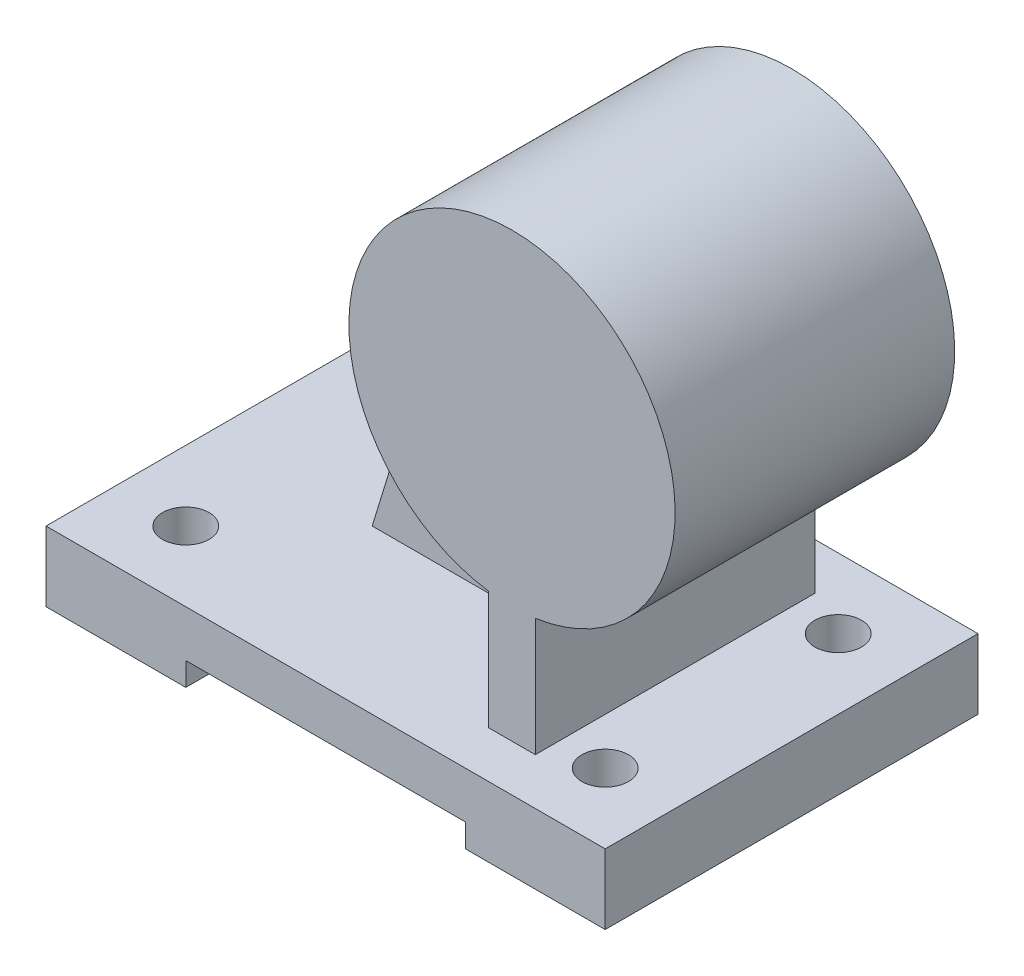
ISO-10303-21;
HEADER;
FILE_DESCRIPTION(('STEP AP214'),'2;1');
FILE_NAME('part.step','',(''),(''),'','','');
FILE_SCHEMA(('AUTOMOTIVE_DESIGN { 1 0 10303 214 1 1 1 1 }'));
ENDSEC;
DATA;
#1=APPLICATION_CONTEXT('core data for automotive mechanical design processes');
#2=APPLICATION_PROTOCOL_DEFINITION('international standard','automotive_design',2000,#1);
#3=PRODUCT_CONTEXT('',#1,'mechanical');
#4=PRODUCT('Part','Part','',(#3));
#5=PRODUCT_RELATED_PRODUCT_CATEGORY('part','',(#4));
#6=PRODUCT_DEFINITION_FORMATION('','',#4);
#7=PRODUCT_DEFINITION_CONTEXT('part definition',#1,'design');
#8=PRODUCT_DEFINITION('design','',#6,#7);
#9=PRODUCT_DEFINITION_SHAPE('','',#8);
#10=(LENGTH_UNIT() NAMED_UNIT(*) SI_UNIT(.MILLI.,.METRE.));
#11=(NAMED_UNIT(*) PLANE_ANGLE_UNIT() SI_UNIT($,.RADIAN.));
#12=(NAMED_UNIT(*) SI_UNIT($,.STERADIAN.) SOLID_ANGLE_UNIT());
#13=UNCERTAINTY_MEASURE_WITH_UNIT(LENGTH_MEASURE(1.E-05),#10,'distance_accuracy_value','');
#14=(GEOMETRIC_REPRESENTATION_CONTEXT(3) GLOBAL_UNCERTAINTY_ASSIGNED_CONTEXT((#13)) GLOBAL_UNIT_ASSIGNED_CONTEXT((#10,
#11,#12)) REPRESENTATION_CONTEXT('',''));
#15=CARTESIAN_POINT('',(0.,0.,0.));
#16=DIRECTION('',(0.,0.,1.));
#17=DIRECTION('',(1.,0.,0.));
#18=AXIS2_PLACEMENT_3D('',#15,#16,#17);
#19=CARTESIAN_POINT('',(2159.,381.,-1778.));
#20=DIRECTION('',(-1.,0.,0.));
#21=DIRECTION('',(0.,-1.,0.));
#22=AXIS2_PLACEMENT_3D('',#19,#20,#21);
#23=PLANE('',#22);
#24=DIRECTION('',(0.,0.,1.));
#25=VECTOR('',#24,1.);
#26=CARTESIAN_POINT('',(2159.,381.,-1778.));
#27=LINE('',#26,#25);
#28=CARTESIAN_POINT('',(2159.,381.,-1778.));
#29=VERTEX_POINT('',#28);
#30=CARTESIAN_POINT('',(2159.,381.,-1143.));
#31=VERTEX_POINT('',#30);
#32=EDGE_CURVE('E198',#29,#31,#27,.T.);
#33=ORIENTED_EDGE('',*,*,#32,.T.);
#34=DIRECTION('',(0.,1.,0.));
#35=VECTOR('',#34,1.);
#36=CARTESIAN_POINT('',(2159.,381.,-1143.));
#37=LINE('',#36,#35);
#38=CARTESIAN_POINT('',(2159.,1025.11818975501,-1143.));
#39=VERTEX_POINT('',#38);
#40=EDGE_CURVE('E164',#31,#39,#37,.T.);
#41=ORIENTED_EDGE('',*,*,#40,.T.);
#42=DIRECTION('',(0.,0.,1.));
#43=VECTOR('',#42,1.);
#44=CARTESIAN_POINT('',(2159.,1025.11818975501,-1778.));
#45=LINE('',#44,#43);
#46=CARTESIAN_POINT('',(2159.,1025.11818975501,-1778.));
#47=VERTEX_POINT('',#46);
#48=EDGE_CURVE('E202',#47,#39,#45,.T.);
#49=ORIENTED_EDGE('',*,*,#48,.F.);
#50=DIRECTION('',(0.,-1.,0.));
#51=VECTOR('',#50,1.);
#52=CARTESIAN_POINT('',(2159.,381.,-1778.));
#53=LINE('',#52,#51);
#54=EDGE_CURVE('E180',#47,#29,#53,.T.);
#55=ORIENTED_EDGE('',*,*,#54,.T.);
#56=EDGE_LOOP('',(#33,#41,#49,#55));
#57=FACE_BOUND('',#56,.T.);
#58=ADVANCED_FACE('F33',(#57),#23,.T.);
#59=CARTESIAN_POINT('',(0.,381.,0.));
#60=DIRECTION('',(0.,1.,0.));
#61=DIRECTION('',(0.,0.,1.));
#62=AXIS2_PLACEMENT_3D('',#59,#60,#61);
#63=PLANE('',#62);
#64=DIRECTION('',(1.,0.,0.));
#65=VECTOR('',#64,1.);
#66=CARTESIAN_POINT('',(889.,381.,-889.));
#67=LINE('',#66,#65);
#68=CARTESIAN_POINT('',(889.,381.,-889.));
#69=VERTEX_POINT('',#68);
#70=CARTESIAN_POINT('',(2159.,381.,-889.));
#71=VERTEX_POINT('',#70);
#72=EDGE_CURVE('E160',#69,#71,#67,.T.);
#73=ORIENTED_EDGE('',*,*,#72,.F.);
#74=DIRECTION('',(0.,0.,-1.));
#75=VECTOR('',#74,1.);
#76=CARTESIAN_POINT('',(889.,381.,-889.));
#77=LINE('',#76,#75);
#78=CARTESIAN_POINT('',(889.,381.,-1143.));
#79=VERTEX_POINT('',#78);
#80=EDGE_CURVE('E158',#69,#79,#77,.T.);
#81=ORIENTED_EDGE('',*,*,#80,.T.);
#82=DIRECTION('',(1.,0.,0.));
#83=VECTOR('',#82,1.);
#84=CARTESIAN_POINT('',(889.,381.,-1143.));
#85=LINE('',#84,#83);
#86=EDGE_CURVE('E527',#79,#31,#85,.T.);
#87=ORIENTED_EDGE('',*,*,#86,.T.);
#88=ORIENTED_EDGE('',*,*,#32,.F.);
#89=DIRECTION('',(1.,0.,0.));
#90=VECTOR('',#89,1.);
#91=CARTESIAN_POINT('',(2413.,381.,-1778.));
#92=LINE('',#91,#90);
#93=CARTESIAN_POINT('',(2413.,381.,-1778.));
#94=VERTEX_POINT('',#93);
#95=EDGE_CURVE('E56',#29,#94,#92,.T.);
#96=ORIENTED_EDGE('',*,*,#95,.T.);
#97=DIRECTION('',(0.,0.,1.));
#98=VECTOR('',#97,1.);
#99=CARTESIAN_POINT('',(2413.,381.,-1778.));
#100=LINE('',#99,#98);
#101=CARTESIAN_POINT('',(2413.,381.,-254.));
#102=VERTEX_POINT('',#101);
#103=EDGE_CURVE('E195',#94,#102,#100,.T.);
#104=ORIENTED_EDGE('',*,*,#103,.T.);
#105=DIRECTION('',(1.,0.,0.));
#106=VECTOR('',#105,1.);
#107=CARTESIAN_POINT('',(2413.,381.,-254.));
#108=LINE('',#107,#106);
#109=CARTESIAN_POINT('',(2159.,381.,-254.));
#110=VERTEX_POINT('',#109);
#111=EDGE_CURVE('E177',#110,#102,#108,.T.);
#112=ORIENTED_EDGE('',*,*,#111,.F.);
#113=EDGE_CURVE('E201',#71,#110,#27,.T.);
#114=ORIENTED_EDGE('',*,*,#113,.F.);
#115=EDGE_LOOP('',(#73,#81,#87,#88,#96,#104,#112,#114));
#116=FACE_BOUND('',#115,.T.);
#117=CARTESIAN_POINT('',(2667.,381.,-1651.));
#118=DIRECTION('',(0.,1.,0.));
#119=DIRECTION('',(0.,0.,1.));
#120=AXIS2_PLACEMENT_3D('',#117,#118,#119);
#121=CIRCLE('',#120,127.);
#122=CARTESIAN_POINT('',(2667.,381.,-1524.));
#123=VERTEX_POINT('',#122);
#124=EDGE_CURVE('E197',#123,#123,#121,.T.);
#125=ORIENTED_EDGE('',*,*,#124,.F.);
#126=EDGE_LOOP('',(#125));
#127=FACE_BOUND('',#126,.T.);
#128=CARTESIAN_POINT('',(2667.,381.,-381.));
#129=DIRECTION('',(0.,1.,0.));
#130=DIRECTION('',(0.,0.,-1.));
#131=AXIS2_PLACEMENT_3D('',#128,#129,#130);
#132=CIRCLE('',#131,127.);
#133=CARTESIAN_POINT('',(2667.,381.,-508.));
#134=VERTEX_POINT('',#133);
#135=EDGE_CURVE('E209',#134,#134,#132,.T.);
#136=ORIENTED_EDGE('',*,*,#135,.F.);
#137=EDGE_LOOP('',(#136));
#138=FACE_BOUND('',#137,.T.);
#139=CARTESIAN_POINT('',(381.,381.,-1651.));
#140=DIRECTION('',(0.,1.,0.));
#141=DIRECTION('',(0.,0.,-1.));
#142=AXIS2_PLACEMENT_3D('',#139,#140,#141);
#143=CIRCLE('',#142,127.);
#144=CARTESIAN_POINT('',(381.,381.,-1778.));
#145=VERTEX_POINT('',#144);
#146=EDGE_CURVE('E215',#145,#145,#143,.T.);
#147=ORIENTED_EDGE('',*,*,#146,.F.);
#148=EDGE_LOOP('',(#147));
#149=FACE_BOUND('',#148,.T.);
#150=CARTESIAN_POINT('',(381.,381.,-381.));
#151=DIRECTION('',(0.,1.,0.));
#152=DIRECTION('',(0.,0.,1.));
#153=AXIS2_PLACEMENT_3D('',#150,#151,#152);
#154=CIRCLE('',#153,127.);
#155=CARTESIAN_POINT('',(381.,381.,-254.));
#156=VERTEX_POINT('',#155);
#157=EDGE_CURVE('E221',#156,#156,#154,.T.);
#158=ORIENTED_EDGE('',*,*,#157,.F.);
#159=EDGE_LOOP('',(#158));
#160=FACE_BOUND('',#159,.T.);
#161=DIRECTION('',(0.,0.,1.));
#162=VECTOR('',#161,1.);
#163=CARTESIAN_POINT('',(0.,381.,-2032.));
#164=LINE('',#163,#162);
#165=CARTESIAN_POINT('',(0.,381.,-2032.));
#166=VERTEX_POINT('',#165);
#167=CARTESIAN_POINT('',(0.,381.,0.));
#168=VERTEX_POINT('',#167);
#169=EDGE_CURVE('E256',#166,#168,#164,.T.);
#170=ORIENTED_EDGE('',*,*,#169,.T.);
#171=DIRECTION('',(1.,0.,0.));
#172=VECTOR('',#171,1.);
#173=CARTESIAN_POINT('',(0.,381.,0.));
#174=LINE('',#173,#172);
#175=CARTESIAN_POINT('',(3048.,381.,0.));
#176=VERTEX_POINT('',#175);
#177=EDGE_CURVE('E259',#168,#176,#174,.T.);
#178=ORIENTED_EDGE('',*,*,#177,.T.);
#179=DIRECTION('',(0.,0.,-1.));
#180=VECTOR('',#179,1.);
#181=CARTESIAN_POINT('',(3048.,381.,0.));
#182=LINE('',#181,#180);
#183=CARTESIAN_POINT('',(3048.,381.,-2032.));
#184=VERTEX_POINT('',#183);
#185=EDGE_CURVE('E262',#176,#184,#182,.T.);
#186=ORIENTED_EDGE('',*,*,#185,.T.);
#187=DIRECTION('',(-1.,0.,0.));
#188=VECTOR('',#187,1.);
#189=CARTESIAN_POINT('',(3048.,381.,-2032.));
#190=LINE('',#189,#188);
#191=EDGE_CURVE('E264',#184,#166,#190,.T.);
#192=ORIENTED_EDGE('',*,*,#191,.T.);
#193=EDGE_LOOP('',(#170,#178,#186,#192));
#194=FACE_BOUND('',#193,.T.);
#195=ADVANCED_FACE('F323',(#116,#127,#138,#149,#160,#194),#63,.T.);
#196=CARTESIAN_POINT('',(0.,0.,0.));
#197=DIRECTION('',(0.,1.,0.));
#198=DIRECTION('',(0.,0.,1.));
#199=AXIS2_PLACEMENT_3D('',#196,#197,#198);
#200=PLANE('',#199);
#201=CARTESIAN_POINT('',(381.,0.,-1651.));
#202=DIRECTION('',(0.,1.,0.));
#203=DIRECTION('',(0.,0.,-1.));
#204=AXIS2_PLACEMENT_3D('',#201,#202,#203);
#205=CIRCLE('',#204,127.);
#206=CARTESIAN_POINT('',(381.,0.,-1778.));
#207=VERTEX_POINT('',#206);
#208=EDGE_CURVE('E218',#207,#207,#205,.T.);
#209=ORIENTED_EDGE('',*,*,#208,.T.);
#210=EDGE_LOOP('',(#209));
#211=FACE_BOUND('',#210,.T.);
#212=CARTESIAN_POINT('',(381.,0.,-381.));
#213=DIRECTION('',(0.,1.,0.));
#214=DIRECTION('',(0.,0.,1.));
#215=AXIS2_PLACEMENT_3D('',#212,#213,#214);
#216=CIRCLE('',#215,127.);
#217=CARTESIAN_POINT('',(381.,0.,-254.));
#218=VERTEX_POINT('',#217);
#219=EDGE_CURVE('E224',#218,#218,#216,.T.);
#220=ORIENTED_EDGE('',*,*,#219,.T.);
#221=EDGE_LOOP('',(#220));
#222=FACE_BOUND('',#221,.T.);
#223=DIRECTION('',(-1.,0.,0.));
#224=VECTOR('',#223,1.);
#225=CARTESIAN_POINT('',(3048.,0.,-2032.));
#226=LINE('',#225,#224);
#227=CARTESIAN_POINT('',(762.,0.,-2032.));
#228=VERTEX_POINT('',#227);
#229=CARTESIAN_POINT('',(0.,0.,-2032.));
#230=VERTEX_POINT('',#229);
#231=EDGE_CURVE('E275',#228,#230,#226,.T.);
#232=ORIENTED_EDGE('',*,*,#231,.F.);
#233=DIRECTION('',(0.,0.,1.));
#234=VECTOR('',#233,1.);
#235=CARTESIAN_POINT('',(762.,0.,-2032.));
#236=LINE('',#235,#234);
#237=CARTESIAN_POINT('',(762.,0.,0.));
#238=VERTEX_POINT('',#237);
#239=EDGE_CURVE('E240',#228,#238,#236,.T.);
#240=ORIENTED_EDGE('',*,*,#239,.T.);
#241=DIRECTION('',(1.,0.,0.));
#242=VECTOR('',#241,1.);
#243=CARTESIAN_POINT('',(0.,0.,0.));
#244=LINE('',#243,#242);
#245=CARTESIAN_POINT('',(0.,0.,0.));
#246=VERTEX_POINT('',#245);
#247=EDGE_CURVE('E270',#246,#238,#244,.T.);
#248=ORIENTED_EDGE('',*,*,#247,.F.);
#249=DIRECTION('',(0.,0.,1.));
#250=VECTOR('',#249,1.);
#251=CARTESIAN_POINT('',(0.,0.,-2032.));
#252=LINE('',#251,#250);
#253=EDGE_CURVE('E249',#230,#246,#252,.T.);
#254=ORIENTED_EDGE('',*,*,#253,.F.);
#255=EDGE_LOOP('',(#232,#240,#248,#254));
#256=FACE_BOUND('',#255,.T.);
#257=ADVANCED_FACE('F299',(#211,#222,#256),#200,.F.);
#258=CARTESIAN_POINT('',(0.,381.,-2032.));
#259=DIRECTION('',(1.,0.,0.));
#260=DIRECTION('',(0.,0.,-1.));
#261=AXIS2_PLACEMENT_3D('',#258,#259,#260);
#262=PLANE('',#261);
#263=ORIENTED_EDGE('',*,*,#253,.T.);
#264=DIRECTION('',(0.,-1.,0.));
#265=VECTOR('',#264,1.);
#266=CARTESIAN_POINT('',(0.,381.,0.));
#267=LINE('',#266,#265);
#268=EDGE_CURVE('E286',#168,#246,#267,.T.);
#269=ORIENTED_EDGE('',*,*,#268,.F.);
#270=ORIENTED_EDGE('',*,*,#169,.F.);
#271=DIRECTION('',(0.,-1.,0.));
#272=VECTOR('',#271,1.);
#273=CARTESIAN_POINT('',(0.,381.,-2032.));
#274=LINE('',#273,#272);
#275=EDGE_CURVE('E266',#166,#230,#274,.T.);
#276=ORIENTED_EDGE('',*,*,#275,.T.);
#277=EDGE_LOOP('',(#263,#269,#270,#276));
#278=FACE_BOUND('',#277,.T.);
#279=ADVANCED_FACE('F35',(#278),#262,.F.);
#280=CARTESIAN_POINT('',(0.,381.,0.));
#281=DIRECTION('',(0.,0.,-1.));
#282=DIRECTION('',(-1.,0.,0.));
#283=AXIS2_PLACEMENT_3D('',#280,#281,#282);
#284=PLANE('',#283);
#285=ORIENTED_EDGE('',*,*,#247,.T.);
#286=DIRECTION('',(0.,-1.,0.));
#287=VECTOR('',#286,1.);
#288=CARTESIAN_POINT('',(762.,127.,0.));
#289=LINE('',#288,#287);
#290=CARTESIAN_POINT('',(762.,127.,0.));
#291=VERTEX_POINT('',#290);
#292=EDGE_CURVE('E227',#291,#238,#289,.T.);
#293=ORIENTED_EDGE('',*,*,#292,.F.);
#294=DIRECTION('',(-1.,0.,0.));
#295=VECTOR('',#294,1.);
#296=CARTESIAN_POINT('',(2286.,127.,0.));
#297=LINE('',#296,#295);
#298=CARTESIAN_POINT('',(2286.,127.,0.));
#299=VERTEX_POINT('',#298);
#300=EDGE_CURVE('E234',#299,#291,#297,.T.);
#301=ORIENTED_EDGE('',*,*,#300,.F.);
#302=DIRECTION('',(0.,1.,0.));
#303=VECTOR('',#302,1.);
#304=CARTESIAN_POINT('',(2286.,0.,0.));
#305=LINE('',#304,#303);
#306=CARTESIAN_POINT('',(2286.,0.,0.));
#307=VERTEX_POINT('',#306);
#308=EDGE_CURVE('E242',#307,#299,#305,.T.);
#309=ORIENTED_EDGE('',*,*,#308,.F.);
#310=CARTESIAN_POINT('',(3048.,0.,0.));
#311=VERTEX_POINT('',#310);
#312=EDGE_CURVE('E269',#307,#311,#244,.T.);
#313=ORIENTED_EDGE('',*,*,#312,.T.);
#314=DIRECTION('',(0.,-1.,0.));
#315=VECTOR('',#314,1.);
#316=CARTESIAN_POINT('',(3048.,381.,0.));
#317=LINE('',#316,#315);
#318=EDGE_CURVE('E283',#176,#311,#317,.T.);
#319=ORIENTED_EDGE('',*,*,#318,.F.);
#320=ORIENTED_EDGE('',*,*,#177,.F.);
#321=ORIENTED_EDGE('',*,*,#268,.T.);
#322=EDGE_LOOP('',(#285,#293,#301,#309,#313,#319,#320,#321));
#323=FACE_BOUND('',#322,.T.);
#324=ADVANCED_FACE('F290',(#323),#284,.F.);
#325=CARTESIAN_POINT('',(3048.,381.,0.));
#326=DIRECTION('',(-1.,0.,0.));
#327=DIRECTION('',(0.,0.,1.));
#328=AXIS2_PLACEMENT_3D('',#325,#326,#327);
#329=PLANE('',#328);
#330=DIRECTION('',(0.,0.,-1.));
#331=VECTOR('',#330,1.);
#332=CARTESIAN_POINT('',(3048.,0.,0.));
#333=LINE('',#332,#331);
#334=CARTESIAN_POINT('',(3048.,0.,-2032.));
#335=VERTEX_POINT('',#334);
#336=EDGE_CURVE('E273',#311,#335,#333,.T.);
#337=ORIENTED_EDGE('',*,*,#336,.T.);
#338=DIRECTION('',(0.,-1.,0.));
#339=VECTOR('',#338,1.);
#340=CARTESIAN_POINT('',(3048.,381.,-2032.));
#341=LINE('',#340,#339);
#342=EDGE_CURVE('E280',#184,#335,#341,.T.);
#343=ORIENTED_EDGE('',*,*,#342,.F.);
#344=ORIENTED_EDGE('',*,*,#185,.F.);
#345=ORIENTED_EDGE('',*,*,#318,.T.);
#346=EDGE_LOOP('',(#337,#343,#344,#345));
#347=FACE_BOUND('',#346,.T.);
#348=ADVANCED_FACE('F319',(#347),#329,.F.);
#349=CARTESIAN_POINT('',(3048.,381.,-2032.));
#350=DIRECTION('',(0.,0.,1.));
#351=DIRECTION('',(1.,0.,0.));
#352=AXIS2_PLACEMENT_3D('',#349,#350,#351);
#353=PLANE('',#352);
#354=DIRECTION('',(-1.,0.,0.));
#355=VECTOR('',#354,1.);
#356=CARTESIAN_POINT('',(2286.,127.,-2032.));
#357=LINE('',#356,#355);
#358=CARTESIAN_POINT('',(2286.,127.,-2032.));
#359=VERTEX_POINT('',#358);
#360=CARTESIAN_POINT('',(762.,127.,-2032.));
#361=VERTEX_POINT('',#360);
#362=EDGE_CURVE('E237',#359,#361,#357,.T.);
#363=ORIENTED_EDGE('',*,*,#362,.T.);
#364=DIRECTION('',(0.,-1.,0.));
#365=VECTOR('',#364,1.);
#366=CARTESIAN_POINT('',(762.,127.,-2032.));
#367=LINE('',#366,#365);
#368=EDGE_CURVE('E230',#361,#228,#367,.T.);
#369=ORIENTED_EDGE('',*,*,#368,.T.);
#370=ORIENTED_EDGE('',*,*,#231,.T.);
#371=ORIENTED_EDGE('',*,*,#275,.F.);
#372=ORIENTED_EDGE('',*,*,#191,.F.);
#373=ORIENTED_EDGE('',*,*,#342,.T.);
#374=CARTESIAN_POINT('',(2286.,0.,-2032.));
#375=VERTEX_POINT('',#374);
#376=EDGE_CURVE('E260',#335,#375,#226,.T.);
#377=ORIENTED_EDGE('',*,*,#376,.T.);
#378=DIRECTION('',(0.,1.,0.));
#379=VECTOR('',#378,1.);
#380=CARTESIAN_POINT('',(2286.,0.,-2032.));
#381=LINE('',#380,#379);
#382=EDGE_CURVE('E233',#375,#359,#381,.T.);
#383=ORIENTED_EDGE('',*,*,#382,.T.);
#384=EDGE_LOOP('',(#363,#369,#370,#371,#372,#373,#377,#383));
#385=FACE_BOUND('',#384,.T.);
#386=ADVANCED_FACE('F304',(#385),#353,.F.);
#387=CARTESIAN_POINT('',(2667.,0.,-1651.));
#388=DIRECTION('',(0.,1.,0.));
#389=DIRECTION('',(0.,0.,1.));
#390=AXIS2_PLACEMENT_3D('',#387,#388,#389);
#391=CIRCLE('',#390,127.);
#392=CARTESIAN_POINT('',(2667.,0.,-1524.));
#393=VERTEX_POINT('',#392);
#394=EDGE_CURVE('E206',#393,#393,#391,.T.);
#395=ORIENTED_EDGE('',*,*,#394,.T.);
#396=EDGE_LOOP('',(#395));
#397=FACE_BOUND('',#396,.T.);
#398=CARTESIAN_POINT('',(2667.,0.,-381.));
#399=DIRECTION('',(0.,1.,0.));
#400=DIRECTION('',(0.,0.,-1.));
#401=AXIS2_PLACEMENT_3D('',#398,#399,#400);
#402=CIRCLE('',#401,127.);
#403=CARTESIAN_POINT('',(2667.,0.,-508.));
#404=VERTEX_POINT('',#403);
#405=EDGE_CURVE('E212',#404,#404,#402,.T.);
#406=ORIENTED_EDGE('',*,*,#405,.T.);
#407=EDGE_LOOP('',(#406));
#408=FACE_BOUND('',#407,.T.);
#409=ORIENTED_EDGE('',*,*,#312,.F.);
#410=DIRECTION('',(0.,0.,1.));
#411=VECTOR('',#410,1.);
#412=CARTESIAN_POINT('',(2286.,0.,-2032.));
#413=LINE('',#412,#411);
#414=EDGE_CURVE('E252',#375,#307,#413,.T.);
#415=ORIENTED_EDGE('',*,*,#414,.F.);
#416=ORIENTED_EDGE('',*,*,#376,.F.);
#417=ORIENTED_EDGE('',*,*,#336,.F.);
#418=EDGE_LOOP('',(#409,#415,#416,#417));
#419=FACE_BOUND('',#418,.T.);
#420=ADVANCED_FACE('F315',(#397,#408,#419),#200,.F.);
#421=CARTESIAN_POINT('',(762.,127.,-2032.));
#422=DIRECTION('',(-1.,0.,0.));
#423=DIRECTION('',(0.,0.,1.));
#424=AXIS2_PLACEMENT_3D('',#421,#422,#423);
#425=PLANE('',#424);
#426=ORIENTED_EDGE('',*,*,#292,.T.);
#427=ORIENTED_EDGE('',*,*,#239,.F.);
#428=ORIENTED_EDGE('',*,*,#368,.F.);
#429=DIRECTION('',(0.,0.,1.));
#430=VECTOR('',#429,1.);
#431=CARTESIAN_POINT('',(762.,127.,-2032.));
#432=LINE('',#431,#430);
#433=EDGE_CURVE('E247',#361,#291,#432,.T.);
#434=ORIENTED_EDGE('',*,*,#433,.T.);
#435=EDGE_LOOP('',(#426,#427,#428,#434));
#436=FACE_BOUND('',#435,.T.);
#437=ADVANCED_FACE('F302',(#436),#425,.F.);
#438=CARTESIAN_POINT('',(2286.,127.,-2032.));
#439=DIRECTION('',(0.,1.,0.));
#440=DIRECTION('',(-1.,0.,0.));
#441=AXIS2_PLACEMENT_3D('',#438,#439,#440);
#442=PLANE('',#441);
#443=ORIENTED_EDGE('',*,*,#300,.T.);
#444=ORIENTED_EDGE('',*,*,#433,.F.);
#445=ORIENTED_EDGE('',*,*,#362,.F.);
#446=DIRECTION('',(0.,0.,1.));
#447=VECTOR('',#446,1.);
#448=CARTESIAN_POINT('',(2286.,127.,-2032.));
#449=LINE('',#448,#447);
#450=EDGE_CURVE('E250',#359,#299,#449,.T.);
#451=ORIENTED_EDGE('',*,*,#450,.T.);
#452=EDGE_LOOP('',(#443,#444,#445,#451));
#453=FACE_BOUND('',#452,.T.);
#454=ADVANCED_FACE('F307',(#453),#442,.F.);
#455=CARTESIAN_POINT('',(2286.,0.,-2032.));
#456=DIRECTION('',(1.,0.,0.));
#457=DIRECTION('',(0.,0.,-1.));
#458=AXIS2_PLACEMENT_3D('',#455,#456,#457);
#459=PLANE('',#458);
#460=ORIENTED_EDGE('',*,*,#308,.T.);
#461=ORIENTED_EDGE('',*,*,#450,.F.);
#462=ORIENTED_EDGE('',*,*,#382,.F.);
#463=ORIENTED_EDGE('',*,*,#414,.T.);
#464=EDGE_LOOP('',(#460,#461,#462,#463));
#465=FACE_BOUND('',#464,.T.);
#466=ADVANCED_FACE('F363',(#465),#459,.F.);
#467=CARTESIAN_POINT('',(381.,0.,-381.));
#468=DIRECTION('',(0.,1.,0.));
#469=DIRECTION('',(0.,0.,1.));
#470=AXIS2_PLACEMENT_3D('',#467,#468,#469);
#471=CYLINDRICAL_SURFACE('',#470,127.);
#472=ORIENTED_EDGE('',*,*,#219,.F.);
#473=EDGE_LOOP('',(#472));
#474=FACE_BOUND('',#473,.T.);
#475=ORIENTED_EDGE('',*,*,#157,.T.);
#476=EDGE_LOOP('',(#475));
#477=FACE_BOUND('',#476,.T.);
#478=ADVANCED_FACE('F375',(#474,#477),#471,.F.);
#479=CARTESIAN_POINT('',(381.,0.,-1651.));
#480=DIRECTION('',(0.,1.,0.));
#481=DIRECTION('',(0.,0.,1.));
#482=AXIS2_PLACEMENT_3D('',#479,#480,#481);
#483=CYLINDRICAL_SURFACE('',#482,127.);
#484=ORIENTED_EDGE('',*,*,#208,.F.);
#485=EDGE_LOOP('',(#484));
#486=FACE_BOUND('',#485,.T.);
#487=ORIENTED_EDGE('',*,*,#146,.T.);
#488=EDGE_LOOP('',(#487));
#489=FACE_BOUND('',#488,.T.);
#490=ADVANCED_FACE('F380',(#486,#489),#483,.F.);
#491=CARTESIAN_POINT('',(2667.,0.,-381.));
#492=DIRECTION('',(0.,1.,0.));
#493=DIRECTION('',(0.,0.,1.));
#494=AXIS2_PLACEMENT_3D('',#491,#492,#493);
#495=CYLINDRICAL_SURFACE('',#494,127.);
#496=ORIENTED_EDGE('',*,*,#405,.F.);
#497=EDGE_LOOP('',(#496));
#498=FACE_BOUND('',#497,.T.);
#499=ORIENTED_EDGE('',*,*,#135,.T.);
#500=EDGE_LOOP('',(#499));
#501=FACE_BOUND('',#500,.T.);
#502=ADVANCED_FACE('F390',(#498,#501),#495,.F.);
#503=CARTESIAN_POINT('',(2667.,0.,-1651.));
#504=DIRECTION('',(0.,1.,0.));
#505=DIRECTION('',(0.,0.,1.));
#506=AXIS2_PLACEMENT_3D('',#503,#504,#505);
#507=CYLINDRICAL_SURFACE('',#506,127.);
#508=ORIENTED_EDGE('',*,*,#394,.F.);
#509=EDGE_LOOP('',(#508));
#510=FACE_BOUND('',#509,.T.);
#511=ORIENTED_EDGE('',*,*,#124,.T.);
#512=EDGE_LOOP('',(#511));
#513=FACE_BOUND('',#512,.T.);
#514=ADVANCED_FACE('F400',(#510,#513),#507,.F.);
#515=CARTESIAN_POINT('',(2413.,381.,-1778.));
#516=DIRECTION('',(1.,0.,0.));
#517=DIRECTION('',(0.,0.,-1.));
#518=AXIS2_PLACEMENT_3D('',#515,#516,#517);
#519=PLANE('',#518);
#520=DIRECTION('',(0.,1.,0.));
#521=VECTOR('',#520,1.);
#522=CARTESIAN_POINT('',(2413.,381.,-254.));
#523=LINE('',#522,#521);
#524=CARTESIAN_POINT('',(2413.,1025.11818975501,-254.));
#525=VERTEX_POINT('',#524);
#526=EDGE_CURVE('E172',#102,#525,#523,.T.);
#527=ORIENTED_EDGE('',*,*,#526,.F.);
#528=ORIENTED_EDGE('',*,*,#103,.F.);
#529=DIRECTION('',(0.,1.,0.));
#530=VECTOR('',#529,1.);
#531=CARTESIAN_POINT('',(2413.,381.,-1778.));
#532=LINE('',#531,#530);
#533=CARTESIAN_POINT('',(2413.,1025.11818975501,-1778.));
#534=VERTEX_POINT('',#533);
#535=EDGE_CURVE('E173',#94,#534,#532,.T.);
#536=ORIENTED_EDGE('',*,*,#535,.T.);
#537=DIRECTION('',(0.,0.,1.));
#538=VECTOR('',#537,1.);
#539=CARTESIAN_POINT('',(2413.,1025.11818975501,-1778.));
#540=LINE('',#539,#538);
#541=EDGE_CURVE('E184',#534,#525,#540,.T.);
#542=ORIENTED_EDGE('',*,*,#541,.T.);
#543=EDGE_LOOP('',(#527,#528,#536,#542));
#544=FACE_BOUND('',#543,.T.);
#545=ADVANCED_FACE('F410',(#544),#519,.T.);
#546=DIRECTION('',(0.,1.,0.));
#547=VECTOR('',#546,1.);
#548=CARTESIAN_POINT('',(2159.,381.,-889.));
#549=LINE('',#548,#547);
#550=CARTESIAN_POINT('',(2159.,1025.11818975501,-889.));
#551=VERTEX_POINT('',#550);
#552=EDGE_CURVE('E149',#71,#551,#549,.T.);
#553=ORIENTED_EDGE('',*,*,#552,.F.);
#554=ORIENTED_EDGE('',*,*,#113,.T.);
#555=DIRECTION('',(0.,-1.,0.));
#556=VECTOR('',#555,1.);
#557=CARTESIAN_POINT('',(2159.,381.,-254.));
#558=LINE('',#557,#556);
#559=CARTESIAN_POINT('',(2159.,1025.11818975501,-254.));
#560=VERTEX_POINT('',#559);
#561=EDGE_CURVE('E190',#560,#110,#558,.T.);
#562=ORIENTED_EDGE('',*,*,#561,.F.);
#563=EDGE_CURVE('E204',#551,#560,#45,.T.);
#564=ORIENTED_EDGE('',*,*,#563,.F.);
#565=EDGE_LOOP('',(#553,#554,#562,#564));
#566=FACE_BOUND('',#565,.T.);
#567=ADVANCED_FACE('F334',(#566),#23,.T.);
#568=CARTESIAN_POINT('',(2286.,1905.,-1778.));
#569=DIRECTION('',(0.,0.,1.));
#570=DIRECTION('',(1.,0.,0.));
#571=AXIS2_PLACEMENT_3D('',#568,#569,#570);
#572=CYLINDRICAL_SURFACE('',#571,889.);
#573=CARTESIAN_POINT('',(2286.,1905.,-889.));
#574=DIRECTION('',(0.,0.,1.));
#575=DIRECTION('',(1.,0.,0.));
#576=AXIS2_PLACEMENT_3D('',#573,#574,#575);
#577=CIRCLE('',#576,889.);
#578=CARTESIAN_POINT('',(1436.03796410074,2165.54853200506,-889.));
#579=VERTEX_POINT('',#578);
#580=EDGE_CURVE('E11',#551,#579,#577,.F.);
#581=ORIENTED_EDGE('',*,*,#580,.F.);
#582=ORIENTED_EDGE('',*,*,#563,.T.);
#583=CARTESIAN_POINT('',(2286.,1905.,-254.));
#584=DIRECTION('',(0.,0.,1.));
#585=DIRECTION('',(1.,0.,0.));
#586=AXIS2_PLACEMENT_3D('',#583,#584,#585);
#587=CIRCLE('',#586,889.);
#588=EDGE_CURVE('E187',#525,#560,#587,.T.);
#589=ORIENTED_EDGE('',*,*,#588,.F.);
#590=ORIENTED_EDGE('',*,*,#541,.F.);
#591=CARTESIAN_POINT('',(2286.,1905.,-1778.));
#592=DIRECTION('',(0.,0.,1.));
#593=DIRECTION('',(1.,0.,0.));
#594=AXIS2_PLACEMENT_3D('',#591,#592,#593);
#595=CIRCLE('',#594,889.);
#596=EDGE_CURVE('E176',#534,#47,#595,.T.);
#597=ORIENTED_EDGE('',*,*,#596,.T.);
#598=ORIENTED_EDGE('',*,*,#48,.T.);
#599=CARTESIAN_POINT('',(2286.,1905.,-1143.));
#600=DIRECTION('',(0.,0.,1.));
#601=DIRECTION('',(1.,0.,0.));
#602=AXIS2_PLACEMENT_3D('',#599,#600,#601);
#603=CIRCLE('',#602,889.);
#604=CARTESIAN_POINT('',(1436.03796410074,2165.54853200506,-1143.));
#605=VERTEX_POINT('',#604);
#606=EDGE_CURVE('E41',#39,#605,#603,.F.);
#607=ORIENTED_EDGE('',*,*,#606,.T.);
#608=DIRECTION('',(0.,0.,-1.));
#609=VECTOR('',#608,1.);
#610=CARTESIAN_POINT('',(1436.03796410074,2165.54853200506,-889.));
#611=LINE('',#610,#609);
#612=EDGE_CURVE('E155',#579,#605,#611,.T.);
#613=ORIENTED_EDGE('',*,*,#612,.F.);
#614=EDGE_LOOP('',(#581,#582,#589,#590,#597,#598,#607,#613));
#615=FACE_BOUND('',#614,.T.);
#616=ADVANCED_FACE('F162',(#615),#572,.T.);
#617=CARTESIAN_POINT('',(2286.,1905.,-1778.));
#618=DIRECTION('',(0.,0.,1.));
#619=DIRECTION('',(1.,0.,0.));
#620=AXIS2_PLACEMENT_3D('',#617,#618,#619);
#621=PLANE('',#620);
#622=ORIENTED_EDGE('',*,*,#535,.F.);
#623=ORIENTED_EDGE('',*,*,#95,.F.);
#624=ORIENTED_EDGE('',*,*,#54,.F.);
#625=ORIENTED_EDGE('',*,*,#596,.F.);
#626=EDGE_LOOP('',(#622,#623,#624,#625));
#627=FACE_BOUND('',#626,.T.);
#628=ADVANCED_FACE('F428',(#627),#621,.F.);
#629=CARTESIAN_POINT('',(2286.,1905.,-254.));
#630=DIRECTION('',(0.,0.,1.));
#631=DIRECTION('',(1.,0.,0.));
#632=AXIS2_PLACEMENT_3D('',#629,#630,#631);
#633=PLANE('',#632);
#634=ORIENTED_EDGE('',*,*,#526,.T.);
#635=ORIENTED_EDGE('',*,*,#588,.T.);
#636=ORIENTED_EDGE('',*,*,#561,.T.);
#637=ORIENTED_EDGE('',*,*,#111,.T.);
#638=EDGE_LOOP('',(#634,#635,#636,#637));
#639=FACE_BOUND('',#638,.T.);
#640=ADVANCED_FACE('F433',(#639),#633,.T.);
#641=CARTESIAN_POINT('',(889.,381.,-889.));
#642=DIRECTION('',(0.956087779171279,-0.293080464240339,0.));
#643=DIRECTION('',(0.293080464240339,0.956087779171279,0.));
#644=AXIS2_PLACEMENT_3D('',#641,#642,#643);
#645=PLANE('',#644);
#646=DIRECTION('',(-0.293080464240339,-0.956087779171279,0.));
#647=VECTOR('',#646,1.);
#648=CARTESIAN_POINT('',(889.,381.,-1143.));
#649=LINE('',#648,#647);
#650=EDGE_CURVE('E48',#605,#79,#649,.T.);
#651=ORIENTED_EDGE('',*,*,#650,.T.);
#652=ORIENTED_EDGE('',*,*,#80,.F.);
#653=DIRECTION('',(-0.293080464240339,-0.956087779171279,0.));
#654=VECTOR('',#653,1.);
#655=CARTESIAN_POINT('',(889.,381.,-889.));
#656=LINE('',#655,#654);
#657=EDGE_CURVE('E146',#579,#69,#656,.T.);
#658=ORIENTED_EDGE('',*,*,#657,.F.);
#659=ORIENTED_EDGE('',*,*,#612,.T.);
#660=EDGE_LOOP('',(#651,#652,#658,#659));
#661=FACE_BOUND('',#660,.T.);
#662=ADVANCED_FACE('F154',(#661),#645,.F.);
#663=CARTESIAN_POINT('',(0.,0.,-889.));
#664=DIRECTION('',(0.,0.,1.));
#665=DIRECTION('',(1.,0.,0.));
#666=AXIS2_PLACEMENT_3D('',#663,#664,#665);
#667=PLANE('',#666);
#668=ORIENTED_EDGE('',*,*,#72,.T.);
#669=ORIENTED_EDGE('',*,*,#552,.T.);
#670=ORIENTED_EDGE('',*,*,#580,.T.);
#671=ORIENTED_EDGE('',*,*,#657,.T.);
#672=EDGE_LOOP('',(#668,#669,#670,#671));
#673=FACE_BOUND('',#672,.T.);
#674=ADVANCED_FACE('F145',(#673),#667,.T.);
#675=CARTESIAN_POINT('',(0.,0.,-1143.));
#676=DIRECTION('',(0.,0.,1.));
#677=DIRECTION('',(1.,0.,0.));
#678=AXIS2_PLACEMENT_3D('',#675,#676,#677);
#679=PLANE('',#678);
#680=ORIENTED_EDGE('',*,*,#40,.F.);
#681=ORIENTED_EDGE('',*,*,#86,.F.);
#682=ORIENTED_EDGE('',*,*,#650,.F.);
#683=ORIENTED_EDGE('',*,*,#606,.F.);
#684=EDGE_LOOP('',(#680,#681,#682,#683));
#685=FACE_BOUND('',#684,.T.);
#686=ADVANCED_FACE('F483',(#685),#679,.F.);
#687=CLOSED_SHELL('',(#58,#195,#257,#279,#324,#348,#386,#420,#437,#454,#466,#478,#490,#502,#514,
#545,#567,#616,#628,#640,#662,#674,#686));
#688=MANIFOLD_SOLID_BREP('B2',#687);
#689=ADVANCED_BREP_SHAPE_REPRESENTATION('',(#18,#688),#14);
#690=SHAPE_DEFINITION_REPRESENTATION(#9,#689);
ENDSEC;
END-ISO-10303-21;
